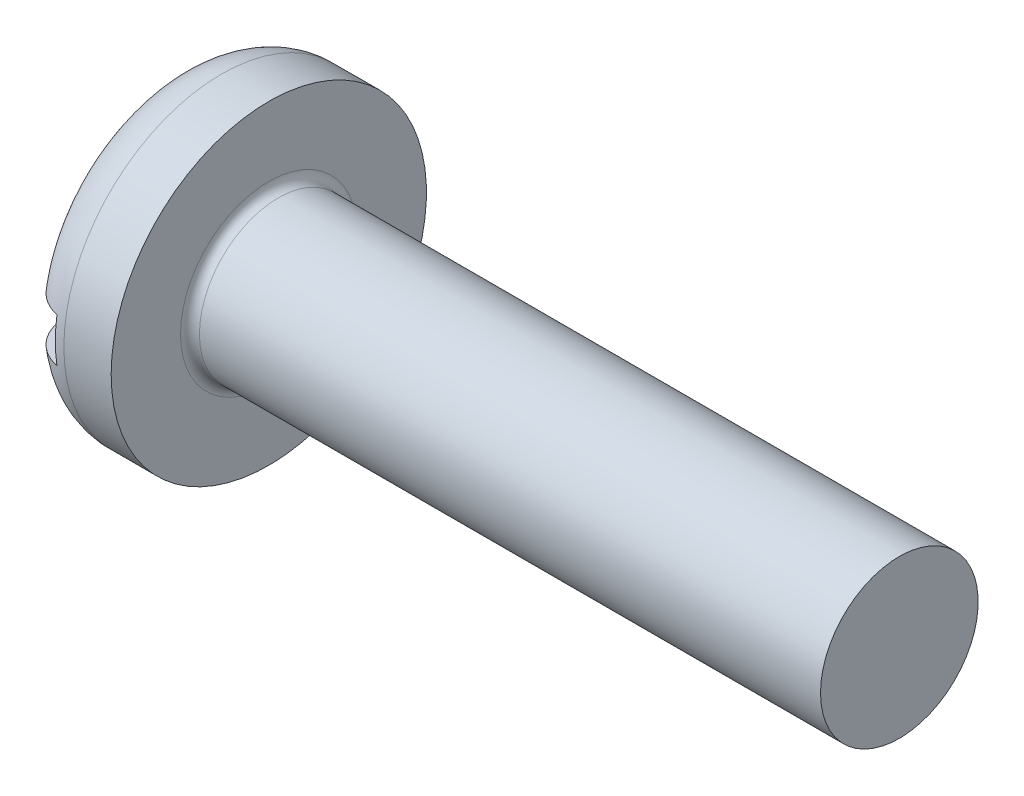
ISO-10303-21;
HEADER;
FILE_DESCRIPTION(('STEP AP214'),'2;1');
FILE_NAME('part.step','',(''),(''),'','','');
FILE_SCHEMA(('AUTOMOTIVE_DESIGN { 1 0 10303 214 1 1 1 1 }'));
ENDSEC;
DATA;
#1=APPLICATION_CONTEXT('core data for automotive mechanical design processes');
#2=APPLICATION_PROTOCOL_DEFINITION('international standard','automotive_design',2000,#1);
#3=PRODUCT_CONTEXT('',#1,'mechanical');
#4=PRODUCT('Part','Part','',(#3));
#5=PRODUCT_RELATED_PRODUCT_CATEGORY('part','',(#4));
#6=PRODUCT_DEFINITION_FORMATION('','',#4);
#7=PRODUCT_DEFINITION_CONTEXT('part definition',#1,'design');
#8=PRODUCT_DEFINITION('design','',#6,#7);
#9=PRODUCT_DEFINITION_SHAPE('','',#8);
#10=(LENGTH_UNIT() NAMED_UNIT(*) SI_UNIT(.MILLI.,.METRE.));
#11=(NAMED_UNIT(*) PLANE_ANGLE_UNIT() SI_UNIT($,.RADIAN.));
#12=(NAMED_UNIT(*) SI_UNIT($,.STERADIAN.) SOLID_ANGLE_UNIT());
#13=UNCERTAINTY_MEASURE_WITH_UNIT(LENGTH_MEASURE(1.E-05),#10,'distance_accuracy_value','');
#14=(GEOMETRIC_REPRESENTATION_CONTEXT(3) GLOBAL_UNCERTAINTY_ASSIGNED_CONTEXT((#13)) GLOBAL_UNIT_ASSIGNED_CONTEXT((#10,
#11,#12)) REPRESENTATION_CONTEXT('',''));
#15=CARTESIAN_POINT('',(0.,0.,0.));
#16=DIRECTION('',(0.,0.,1.));
#17=DIRECTION('',(1.,0.,0.));
#18=AXIS2_PLACEMENT_3D('',#15,#16,#17);
#19=CARTESIAN_POINT('',(0.,0.,0.));
#20=DIRECTION('',(1.,0.,0.));
#21=DIRECTION('',(0.,0.,-1.));
#22=AXIS2_PLACEMENT_3D('',#19,#20,#21);
#23=PLANE('',#22);
#24=CARTESIAN_POINT('',(0.,0.,0.));
#25=DIRECTION('',(1.,0.,0.));
#26=DIRECTION('',(0.,0.,-1.));
#27=AXIS2_PLACEMENT_3D('',#24,#25,#26);
#28=CIRCLE('',#27,7.);
#29=CARTESIAN_POINT('',(0.,1.405,6.85754876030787));
#30=VERTEX_POINT('',#29);
#31=CARTESIAN_POINT('',(0.,1.405,-6.85754876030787));
#32=VERTEX_POINT('',#31);
#33=EDGE_CURVE('E93',#30,#32,#28,.F.);
#34=ORIENTED_EDGE('',*,*,#33,.T.);
#35=DIRECTION('',(0.,0.,-1.));
#36=VECTOR('',#35,1.);
#37=CARTESIAN_POINT('',(0.,1.405,-10.));
#38=LINE('',#37,#36);
#39=EDGE_CURVE('E85',#30,#32,#38,.T.);
#40=ORIENTED_EDGE('',*,*,#39,.F.);
#41=EDGE_LOOP('',(#34,#40));
#42=FACE_BOUND('',#41,.T.);
#43=ADVANCED_FACE('F33',(#42),#23,.F.);
#44=CARTESIAN_POINT('',(0.,-1.405,-6.85754876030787));
#45=VERTEX_POINT('',#44);
#46=CARTESIAN_POINT('',(0.,-1.405,6.85754876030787));
#47=VERTEX_POINT('',#46);
#48=EDGE_CURVE('E84',#45,#47,#28,.F.);
#49=ORIENTED_EDGE('',*,*,#48,.T.);
#50=DIRECTION('',(0.,0.,1.));
#51=VECTOR('',#50,1.);
#52=CARTESIAN_POINT('',(0.,-1.405,-10.));
#53=LINE('',#52,#51);
#54=EDGE_CURVE('E77',#45,#47,#53,.T.);
#55=ORIENTED_EDGE('',*,*,#54,.F.);
#56=EDGE_LOOP('',(#49,#55));
#57=FACE_BOUND('',#56,.T.);
#58=ADVANCED_FACE('F83',(#57),#23,.F.);
#59=CARTESIAN_POINT('',(0.,0.,0.));
#60=DIRECTION('',(-1.,0.,0.));
#61=DIRECTION('',(0.,0.,1.));
#62=AXIS2_PLACEMENT_3D('',#59,#60,#61);
#63=CYLINDRICAL_SURFACE('',#62,10.);
#64=CARTESIAN_POINT('',(3.,0.,0.));
#65=DIRECTION('',(1.,0.,0.));
#66=DIRECTION('',(0.,0.,-1.));
#67=AXIS2_PLACEMENT_3D('',#64,#65,#66);
#68=CIRCLE('',#67,10.);
#69=CARTESIAN_POINT('',(3.,0.,-10.));
#70=VERTEX_POINT('',#69);
#71=EDGE_CURVE('E92',#70,#70,#68,.T.);
#72=ORIENTED_EDGE('',*,*,#71,.T.);
#73=EDGE_LOOP('',(#72));
#74=FACE_BOUND('',#73,.T.);
#75=CARTESIAN_POINT('',(6.,0.,0.));
#76=DIRECTION('',(-1.,0.,0.));
#77=DIRECTION('',(0.,0.,1.));
#78=AXIS2_PLACEMENT_3D('',#75,#76,#77);
#79=CIRCLE('',#78,10.);
#80=CARTESIAN_POINT('',(6.,0.,10.));
#81=VERTEX_POINT('',#80);
#82=EDGE_CURVE('E99',#81,#81,#79,.T.);
#83=ORIENTED_EDGE('',*,*,#82,.T.);
#84=EDGE_LOOP('',(#83));
#85=FACE_BOUND('',#84,.T.);
#86=ADVANCED_FACE('F143',(#74,#85),#63,.T.);
#87=CARTESIAN_POINT('',(6.,10.,0.));
#88=DIRECTION('',(-1.,0.,0.));
#89=DIRECTION('',(0.,0.,1.));
#90=AXIS2_PLACEMENT_3D('',#87,#88,#89);
#91=PLANE('',#90);
#92=CARTESIAN_POINT('',(6.,0.,0.));
#93=DIRECTION('',(-1.,0.,0.));
#94=DIRECTION('',(0.,0.,1.));
#95=AXIS2_PLACEMENT_3D('',#92,#93,#94);
#96=CIRCLE('',#95,5.6);
#97=CARTESIAN_POINT('',(6.,0.,5.6));
#98=VERTEX_POINT('',#97);
#99=EDGE_CURVE('E96',#98,#98,#96,.T.);
#100=ORIENTED_EDGE('',*,*,#99,.T.);
#101=EDGE_LOOP('',(#100));
#102=FACE_BOUND('',#101,.T.);
#103=ORIENTED_EDGE('',*,*,#82,.F.);
#104=EDGE_LOOP('',(#103));
#105=FACE_BOUND('',#104,.T.);
#106=ADVANCED_FACE('F139',(#102,#105),#91,.F.);
#107=CARTESIAN_POINT('',(0.,0.,0.));
#108=DIRECTION('',(-1.,0.,0.));
#109=DIRECTION('',(0.,0.,1.));
#110=AXIS2_PLACEMENT_3D('',#107,#108,#109);
#111=CYLINDRICAL_SURFACE('',#110,5.);
#112=CARTESIAN_POINT('',(6.6,0.,0.));
#113=DIRECTION('',(-1.,0.,0.));
#114=DIRECTION('',(0.,0.,1.));
#115=AXIS2_PLACEMENT_3D('',#112,#113,#114);
#116=CIRCLE('',#115,5.);
#117=CARTESIAN_POINT('',(6.6,0.,5.));
#118=VERTEX_POINT('',#117);
#119=EDGE_CURVE('E105',#118,#118,#116,.F.);
#120=ORIENTED_EDGE('',*,*,#119,.T.);
#121=EDGE_LOOP('',(#120));
#122=FACE_BOUND('',#121,.T.);
#123=CARTESIAN_POINT('',(46.,0.,0.));
#124=DIRECTION('',(-1.,0.,0.));
#125=DIRECTION('',(0.,0.,1.));
#126=AXIS2_PLACEMENT_3D('',#123,#124,#125);
#127=CIRCLE('',#126,5.);
#128=CARTESIAN_POINT('',(46.,0.,5.));
#129=VERTEX_POINT('',#128);
#130=EDGE_CURVE('E160',#129,#129,#127,.T.);
#131=ORIENTED_EDGE('',*,*,#130,.T.);
#132=EDGE_LOOP('',(#131));
#133=FACE_BOUND('',#132,.T.);
#134=ADVANCED_FACE('F135',(#122,#133),#111,.T.);
#135=CARTESIAN_POINT('',(46.,5.,0.));
#136=DIRECTION('',(-1.,0.,0.));
#137=DIRECTION('',(0.,0.,1.));
#138=AXIS2_PLACEMENT_3D('',#135,#136,#137);
#139=PLANE('',#138);
#140=ORIENTED_EDGE('',*,*,#130,.F.);
#141=EDGE_LOOP('',(#140));
#142=FACE_BOUND('',#141,.T.);
#143=ADVANCED_FACE('F128',(#142),#139,.F.);
#144=CARTESIAN_POINT('',(3.,0.,0.));
#145=DIRECTION('',(1.,0.,0.));
#146=DIRECTION('',(0.,0.,-1.));
#147=AXIS2_PLACEMENT_3D('',#144,#145,#146);
#148=TOROIDAL_SURFACE('',#147,7.,3.);
#149=CARTESIAN_POINT('',(1.34955640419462,1.405,-9.40078910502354));
#150=CARTESIAN_POINT('',(1.48879597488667,1.405,-9.49353120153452));
#151=CARTESIAN_POINT('',(1.63593026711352,1.405,-9.57463164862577));
#152=CARTESIAN_POINT('',(1.94183816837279,1.405,-9.71106416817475));
#153=CARTESIAN_POINT('',(2.10062466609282,1.405,-9.76636719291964));
#154=CARTESIAN_POINT('',(2.42520767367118,1.405,-9.84947012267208));
#155=CARTESIAN_POINT('',(2.59100215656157,1.405,-9.87727792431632));
#156=CARTESIAN_POINT('',(2.92486435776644,1.405,-9.90457544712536));
#157=CARTESIAN_POINT('',(3.09293152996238,1.405,-9.90407185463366));
#158=CARTESIAN_POINT('',(3.42617704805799,1.405,-9.87481774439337));
#159=CARTESIAN_POINT('',(3.59136140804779,1.405,-9.84613568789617));
#160=CARTESIAN_POINT('',(3.91458160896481,1.405,-9.76147201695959));
#161=CARTESIAN_POINT('',(4.07261723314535,1.405,-9.7054895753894));
#162=CARTESIAN_POINT('',(4.37724541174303,1.405,-9.56780073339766));
#163=CARTESIAN_POINT('',(4.52382605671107,1.405,-9.48606799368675));
#164=CARTESIAN_POINT('',(4.80128628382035,1.405,-9.29928792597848));
#165=CARTESIAN_POINT('',(4.93216560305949,1.405,-9.19424020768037));
#166=CARTESIAN_POINT('',(5.17535921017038,1.405,-8.96319642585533));
#167=CARTESIAN_POINT('',(5.28756102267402,1.405,-8.8370820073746));
#168=CARTESIAN_POINT('',(5.48946156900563,1.405,-8.56797826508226));
#169=CARTESIAN_POINT('',(5.57915940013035,1.405,-8.42498826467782));
#170=CARTESIAN_POINT('',(5.73457932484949,1.405,-8.12457615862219));
#171=CARTESIAN_POINT('',(5.80003374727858,1.405,-7.96701562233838));
#172=CARTESIAN_POINT('',(5.90400580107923,1.405,-7.64325136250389));
#173=CARTESIAN_POINT('',(5.94252156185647,1.405,-7.47704703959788));
#174=CARTESIAN_POINT('',(5.99219224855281,1.405,-7.13797894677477));
#175=CARTESIAN_POINT('',(6.00291535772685,1.405,-6.96505196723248));
#176=CARTESIAN_POINT('',(5.99572826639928,1.405,-6.61979813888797));
#177=CARTESIAN_POINT('',(5.97781531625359,1.405,-6.44747134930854));
#178=CARTESIAN_POINT('',(5.91349214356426,1.405,-6.10496456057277));
#179=CARTESIAN_POINT('',(5.8665682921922,1.405,-5.93488099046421));
#180=CARTESIAN_POINT('',(5.74524036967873,1.405,-5.60480593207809));
#181=CARTESIAN_POINT('',(5.67083305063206,1.405,-5.444815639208));
#182=CARTESIAN_POINT('',(5.49537114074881,1.405,-5.13716246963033));
#183=CARTESIAN_POINT('',(5.39395573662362,1.405,-4.98970513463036));
#184=CARTESIAN_POINT('',(5.16767260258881,1.405,-4.7139904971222));
#185=CARTESIAN_POINT('',(5.04280270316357,1.405,-4.58573497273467));
#186=CARTESIAN_POINT('',(4.77368816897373,1.405,-4.35327294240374));
#187=CARTESIAN_POINT('',(4.6295670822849,1.405,-4.24892374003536));
#188=CARTESIAN_POINT('',(4.32522065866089,1.405,-4.06716162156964));
#189=CARTESIAN_POINT('',(4.16500054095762,1.405,-3.98974001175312));
#190=CARTESIAN_POINT('',(3.84030664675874,1.405,-3.8679477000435));
#191=CARTESIAN_POINT('',(3.676314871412,1.405,-3.82229480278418));
#192=CARTESIAN_POINT('',(3.34283714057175,1.405,-3.76101136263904));
#193=CARTESIAN_POINT('',(3.17335378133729,1.405,-3.74536683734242));
#194=CARTESIAN_POINT('',(2.84379787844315,1.405,-3.74490534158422));
#195=CARTESIAN_POINT('',(2.68372521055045,1.405,-3.75842524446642));
#196=CARTESIAN_POINT('',(2.36817167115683,1.405,-3.81228751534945));
#197=CARTESIAN_POINT('',(2.21269092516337,1.405,-3.85263061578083));
#198=CARTESIAN_POINT('',(1.91111604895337,1.405,-3.95817017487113));
#199=CARTESIAN_POINT('',(1.76498868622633,1.405,-4.02327219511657));
#200=CARTESIAN_POINT('',(1.48497822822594,1.405,-4.17591024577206));
#201=CARTESIAN_POINT('',(1.3510977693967,1.405,-4.26345109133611));
#202=CARTESIAN_POINT('',(1.0920675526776,1.405,-4.46321328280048));
#203=CARTESIAN_POINT('',(0.967715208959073,1.405,-4.5764683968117));
#204=CARTESIAN_POINT('',(0.738674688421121,1.405,-4.82137026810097));
#205=CARTESIAN_POINT('',(0.633991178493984,1.405,-4.95302137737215));
#206=CARTESIAN_POINT('',(0.442157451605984,1.405,-5.23800445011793));
#207=CARTESIAN_POINT('',(0.356110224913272,1.405,-5.39208030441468));
#208=CARTESIAN_POINT('',(0.210647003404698,1.405,-5.71233809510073));
#209=CARTESIAN_POINT('',(0.151233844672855,1.405,-5.87852131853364));
#210=CARTESIAN_POINT('',(0.0601105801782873,1.405,-6.22102624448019));
#211=CARTESIAN_POINT('',(0.0288317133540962,1.405,-6.39746303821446));
#212=CARTESIAN_POINT('',(-0.00333204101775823,1.405,-6.75308736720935));
#213=CARTESIAN_POINT('',(-0.0042191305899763,1.405,-6.93227470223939));
#214=CARTESIAN_POINT('',(0.0245567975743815,1.405,-7.28631739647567));
#215=CARTESIAN_POINT('',(0.0539031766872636,1.405,-7.46119840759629));
#216=CARTESIAN_POINT('',(0.142109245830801,1.405,-7.80341005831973));
#217=CARTESIAN_POINT('',(0.200973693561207,1.405,-7.97073947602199));
#218=CARTESIAN_POINT('',(0.345399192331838,1.405,-8.28983936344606));
#219=CARTESIAN_POINT('',(0.430465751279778,1.405,-8.44183397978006));
#220=CARTESIAN_POINT('',(0.625268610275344,1.405,-8.72890876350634));
#221=CARTESIAN_POINT('',(0.73497205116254,1.405,-8.86401109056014));
#222=CARTESIAN_POINT('',(0.930061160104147,1.405,-9.06590290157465));
#223=CARTESIAN_POINT('',(1.00887229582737,1.405,-9.13915754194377));
#224=CARTESIAN_POINT('',(1.17388808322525,1.405,-9.27680643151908));
#225=CARTESIAN_POINT('',(1.26009266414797,1.405,-9.34120076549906));
#226=CARTESIAN_POINT('',(1.34955640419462,1.405,-9.40078910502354));
#227=B_SPLINE_CURVE_WITH_KNOTS('',3,(#149,#150,#151,#152,#153,#154,#155,#156,#157,#158,#159,
#160,#161,#162,#163,#164,#165,#166,#167,#168,#169,#170,#171,#172,#173,#174,#175,#176,#177,#178,
#179,#180,#181,#182,#183,#184,#185,#186,#187,#188,#189,#190,#191,#192,#193,#194,#195,#196,#197,
#198,#199,#200,#201,#202,#203,#204,#205,#206,#207,#208,#209,#210,#211,#212,#213,#214,#215,#216,
#217,#218,#219,#220,#221,#222,#223,#224,#225,#226),.UNSPECIFIED.,.T.,.F.,(4,2,2,2,2,2,2,2,2,2,2,
2,2,2,2,2,2,2,2,2,2,2,2,2,2,2,2,2,2,2,2,2,2,2,2,2,2,2,4),(0.,0.501505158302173,1.0035736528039,
1.50549791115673,2.0073036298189,2.50789318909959,3.00849791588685,3.50961636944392,
4.01074321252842,4.51478645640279,5.01884991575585,5.5283236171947,6.0378326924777,
6.55521186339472,7.07264071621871,7.59950372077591,8.12642900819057,8.66078135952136,
9.19518316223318,9.72630681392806,10.25725882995,10.7652962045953,11.2730968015,
11.7527077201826,12.2323317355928,12.7101443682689,13.1880596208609,13.6904322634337,
14.1929239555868,14.7199022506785,15.246936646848,15.7819181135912,16.3168608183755,
16.846257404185,17.3757393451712,17.8957847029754,18.4151405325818,18.7373690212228,
19.0595944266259),.UNSPECIFIED.);
#228=CARTESIAN_POINT('',(2.4,1.405,-9.83958346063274));
#229=VERTEX_POINT('',#228);
#230=EDGE_CURVE('E11',#32,#229,#227,.T.);
#231=ORIENTED_EDGE('',*,*,#230,.F.);
#232=ORIENTED_EDGE('',*,*,#33,.F.);
#233=CARTESIAN_POINT('',(1.31929866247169,1.405,4.29082361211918));
#234=CARTESIAN_POINT('',(1.45286647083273,1.405,4.19577245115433));
#235=CARTESIAN_POINT('',(1.59416934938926,1.405,4.11144874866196));
#236=CARTESIAN_POINT('',(1.88885767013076,1.405,3.9672578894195));
#237=CARTESIAN_POINT('',(2.0422496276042,1.405,3.90740402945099));
#238=CARTESIAN_POINT('',(2.35732943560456,1.405,3.81459653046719));
#239=CARTESIAN_POINT('',(2.51903214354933,1.405,3.78169298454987));
#240=CARTESIAN_POINT('',(2.8456648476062,1.405,3.74457442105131));
#241=CARTESIAN_POINT('',(3.01059369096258,1.405,3.74034933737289));
#242=CARTESIAN_POINT('',(3.33333020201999,1.405,3.76043743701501));
#243=CARTESIAN_POINT('',(3.49119597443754,1.405,3.7838345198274));
#244=CARTESIAN_POINT('',(3.80082163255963,1.405,3.85657629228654));
#245=CARTESIAN_POINT('',(3.95258070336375,1.405,3.90592443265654));
#246=CARTESIAN_POINT('',(4.24742509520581,1.405,4.02910768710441));
#247=CARTESIAN_POINT('',(4.39041702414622,1.405,4.1031654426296));
#248=CARTESIAN_POINT('',(4.66283508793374,1.405,4.27301479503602));
#249=CARTESIAN_POINT('',(4.79225817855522,1.405,4.36881125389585));
#250=CARTESIAN_POINT('',(5.04140734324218,1.405,4.58508449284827));
#251=CARTESIAN_POINT('',(5.16020527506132,1.405,4.70663085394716));
#252=CARTESIAN_POINT('',(5.37676607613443,1.405,4.96720910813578));
#253=CARTESIAN_POINT('',(5.4745243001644,1.405,5.10624485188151));
#254=CARTESIAN_POINT('',(5.65039445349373,1.405,5.404478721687));
#255=CARTESIAN_POINT('',(5.72746808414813,1.405,5.56429044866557));
#256=CARTESIAN_POINT('',(5.85398164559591,1.405,5.89451078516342));
#257=CARTESIAN_POINT('',(5.90341948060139,1.405,6.06492019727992));
#258=CARTESIAN_POINT('',(5.97343316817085,1.405,6.41321282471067));
#259=CARTESIAN_POINT('',(5.99374070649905,1.405,6.59115017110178));
#260=CARTESIAN_POINT('',(6.00378122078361,1.405,6.9478934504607));
#261=CARTESIAN_POINT('',(5.99351574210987,1.405,7.12669933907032));
#262=CARTESIAN_POINT('',(5.94275147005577,1.405,7.47762528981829));
#263=CARTESIAN_POINT('',(5.90264330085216,1.405,7.64980176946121));
#264=CARTESIAN_POINT('',(5.79354154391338,1.405,7.98475159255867));
#265=CARTESIAN_POINT('',(5.72455071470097,1.405,8.14752583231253));
#266=CARTESIAN_POINT('',(5.56103031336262,1.405,8.45584633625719));
#267=CARTESIAN_POINT('',(5.46699591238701,1.405,8.60165524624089));
#268=CARTESIAN_POINT('',(5.25541224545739,1.405,8.87508027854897));
#269=CARTESIAN_POINT('',(5.13786507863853,1.405,9.00269802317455));
#270=CARTESIAN_POINT('',(4.88462978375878,1.405,9.233997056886));
#271=CARTESIAN_POINT('',(4.74925929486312,1.405,9.33802620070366));
#272=CARTESIAN_POINT('',(4.46281557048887,1.405,9.52158182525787));
#273=CARTESIAN_POINT('',(4.31174335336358,1.405,9.60110989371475));
#274=CARTESIAN_POINT('',(3.999977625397,1.405,9.73253259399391));
#275=CARTESIAN_POINT('',(3.83940768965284,1.405,9.78472049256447));
#276=CARTESIAN_POINT('',(3.51175990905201,1.405,9.86121968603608));
#277=CARTESIAN_POINT('',(3.344682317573,1.405,9.88553206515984));
#278=CARTESIAN_POINT('',(3.00981166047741,1.405,9.90549520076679));
#279=CARTESIAN_POINT('',(2.84202855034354,1.405,9.90131334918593));
#280=CARTESIAN_POINT('',(2.50955466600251,1.405,9.86480760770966));
#281=CARTESIAN_POINT('',(2.34486384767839,1.405,9.83248411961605));
#282=CARTESIAN_POINT('',(2.02341276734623,1.405,9.74069922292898));
#283=CARTESIAN_POINT('',(1.86664457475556,1.405,9.68126557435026));
#284=CARTESIAN_POINT('',(1.56526114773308,1.405,9.5370165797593));
#285=CARTESIAN_POINT('',(1.42064600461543,1.405,9.45220104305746));
#286=CARTESIAN_POINT('',(1.14706627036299,1.405,9.25930055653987));
#287=CARTESIAN_POINT('',(1.01816199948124,1.405,9.15113008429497));
#288=CARTESIAN_POINT('',(0.780156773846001,1.405,8.91484933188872));
#289=CARTESIAN_POINT('',(0.671056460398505,1.405,8.78673840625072));
#290=CARTESIAN_POINT('',(0.474713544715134,1.405,8.51306937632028));
#291=CARTESIAN_POINT('',(0.387666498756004,1.405,8.36737101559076));
#292=CARTESIAN_POINT('',(0.238901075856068,1.405,8.06357816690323));
#293=CARTESIAN_POINT('',(0.177184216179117,1.405,7.90548293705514));
#294=CARTESIAN_POINT('',(0.079899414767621,1.405,7.57911909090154));
#295=CARTESIAN_POINT('',(0.044695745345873,1.405,7.41074194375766));
#296=CARTESIAN_POINT('',(0.00253465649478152,1.405,7.07050005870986));
#297=CARTESIAN_POINT('',(-0.00442147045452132,1.405,6.89863516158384));
#298=CARTESIAN_POINT('',(0.00996591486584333,1.405,6.55310394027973));
#299=CARTESIAN_POINT('',(0.0318033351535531,1.405,6.37945821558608));
#300=CARTESIAN_POINT('',(0.103814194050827,1.405,6.03809931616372));
#301=CARTESIAN_POINT('',(0.153997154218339,1.405,5.87038815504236));
#302=CARTESIAN_POINT('',(0.282308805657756,1.405,5.54259653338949));
#303=CARTESIAN_POINT('',(0.360916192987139,1.405,5.38270356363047));
#304=CARTESIAN_POINT('',(0.543669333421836,1.405,5.07838245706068));
#305=CARTESIAN_POINT('',(0.647791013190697,1.405,4.93393992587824));
#306=CARTESIAN_POINT('',(0.845230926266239,1.405,4.70375730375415));
#307=CARTESIAN_POINT('',(0.932931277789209,1.405,4.61313821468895));
#308=CARTESIAN_POINT('',(1.11866613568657,1.405,4.4431775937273));
#309=CARTESIAN_POINT('',(1.21670042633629,1.405,4.36383582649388));
#310=CARTESIAN_POINT('',(1.31929866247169,1.405,4.29082361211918));
#311=B_SPLINE_CURVE_WITH_KNOTS('',3,(#233,#234,#235,#236,#237,#238,#239,#240,#241,#242,#243,
#244,#245,#246,#247,#248,#249,#250,#251,#252,#253,#254,#255,#256,#257,#258,#259,#260,#261,#262,
#263,#264,#265,#266,#267,#268,#269,#270,#271,#272,#273,#274,#275,#276,#277,#278,#279,#280,#281,
#282,#283,#284,#285,#286,#287,#288,#289,#290,#291,#292,#293,#294,#295,#296,#297,#298,#299,#300,
#301,#302,#303,#304,#305,#306,#307,#308,#309,#310),.UNSPECIFIED.,.T.,.F.,(4,2,2,2,2,2,2,2,2,2,2,
2,2,2,2,2,2,2,2,2,2,2,2,2,2,2,2,2,2,2,2,2,2,2,2,2,2,2,4),(0.,0.491384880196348,
0.983036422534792,1.47559974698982,1.96799017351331,2.44449864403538,2.9210704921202,
3.40205789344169,3.88315297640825,4.39077460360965,4.89850819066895,5.42830477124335,
5.95814152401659,6.49282785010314,7.02748714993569,7.55526852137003,8.08299949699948,
8.6009845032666,9.11892328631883,9.6286391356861,10.1383219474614,10.6424194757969,
11.1464973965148,11.6476166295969,12.1487287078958,12.6493288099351,13.1499326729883,
13.6524017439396,14.1548870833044,14.6616834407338,15.1685101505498,15.6821792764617,
16.1958719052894,16.718491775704,17.2412873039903,17.773331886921,18.3048763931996,
18.6823346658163,19.0597850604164),.UNSPECIFIED.);
#312=CARTESIAN_POINT('',(2.4,1.405,9.83958346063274));
#313=VERTEX_POINT('',#312);
#314=EDGE_CURVE('E115',#313,#30,#311,.T.);
#315=ORIENTED_EDGE('',*,*,#314,.F.);
#316=CARTESIAN_POINT('',(2.4,0.,0.));
#317=DIRECTION('',(-1.,0.,0.));
#318=DIRECTION('',(0.,0.,1.));
#319=AXIS2_PLACEMENT_3D('',#316,#317,#318);
#320=CIRCLE('',#319,9.93938769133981);
#321=CARTESIAN_POINT('',(2.4,-1.405,9.83958346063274));
#322=VERTEX_POINT('',#321);
#323=EDGE_CURVE('E108',#313,#322,#320,.F.);
#324=ORIENTED_EDGE('',*,*,#323,.T.);
#325=CARTESIAN_POINT('',(1.31929866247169,-1.405,4.29082361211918));
#326=CARTESIAN_POINT('',(1.17578997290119,-1.405,4.39296323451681));
#327=CARTESIAN_POINT('',(1.04100610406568,-1.405,4.50764267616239));
#328=CARTESIAN_POINT('',(0.792517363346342,-1.405,4.75817905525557));
#329=CARTESIAN_POINT('',(0.678851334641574,-1.405,4.89407418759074));
#330=CARTESIAN_POINT('',(0.475850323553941,-1.405,5.18266479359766));
#331=CARTESIAN_POINT('',(0.386478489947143,-1.405,5.33533432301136));
#332=CARTESIAN_POINT('',(0.234281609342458,-1.405,5.65329273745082));
#333=CARTESIAN_POINT('',(0.171445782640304,-1.405,5.81857646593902));
#334=CARTESIAN_POINT('',(0.0734555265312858,-1.405,6.15951632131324));
#335=CARTESIAN_POINT('',(0.0386734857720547,-1.405,6.33527975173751));
#336=CARTESIAN_POINT('',(-0.000597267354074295,-1.405,6.69018328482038));
#337=CARTESIAN_POINT('',(-0.00508430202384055,-1.405,6.86932357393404));
#338=CARTESIAN_POINT('',(0.0165532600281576,-1.405,7.22408001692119));
#339=CARTESIAN_POINT('',(0.0423929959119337,-1.405,7.3997134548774));
#340=CARTESIAN_POINT('',(0.123750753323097,-1.405,7.74397123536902));
#341=CARTESIAN_POINT('',(0.179265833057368,-1.405,7.91259627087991));
#342=CARTESIAN_POINT('',(0.317309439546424,-1.405,8.23477352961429));
#343=CARTESIAN_POINT('',(0.39932847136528,-1.405,8.38854405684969));
#344=CARTESIAN_POINT('',(0.588441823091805,-1.405,8.6798077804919));
#345=CARTESIAN_POINT('',(0.695533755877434,-1.405,8.81730252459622));
#346=CARTESIAN_POINT('',(0.929779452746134,-1.405,9.06967233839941));
#347=CARTESIAN_POINT('',(1.05656456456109,-1.405,9.18488966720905));
#348=CARTESIAN_POINT('',(1.3278837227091,-1.405,9.3920851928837));
#349=CARTESIAN_POINT('',(1.47241653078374,-1.405,9.48406500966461));
#350=CARTESIAN_POINT('',(1.77321469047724,-1.405,9.64103173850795));
#351=CARTESIAN_POINT('',(1.92931541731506,-1.405,9.70633423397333));
#352=CARTESIAN_POINT('',(2.25031311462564,-1.405,9.80959346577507));
#353=CARTESIAN_POINT('',(2.41520968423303,-1.405,9.84755144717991));
#354=CARTESIAN_POINT('',(2.74786501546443,-1.405,9.89481576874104));
#355=CARTESIAN_POINT('',(2.91559527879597,-1.405,9.90432288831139));
#356=CARTESIAN_POINT('',(3.25026165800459,-1.405,9.89497489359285));
#357=CARTESIAN_POINT('',(3.41719778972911,-1.405,9.87612034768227));
#358=CARTESIAN_POINT('',(3.74516229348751,-1.405,9.81068107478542));
#359=CARTESIAN_POINT('',(3.90620270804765,-1.405,9.76415665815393));
#360=CARTESIAN_POINT('',(4.2182152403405,-1.405,9.64479873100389));
#361=CARTESIAN_POINT('',(4.36918733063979,-1.405,9.57196514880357));
#362=CARTESIAN_POINT('',(4.65722194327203,-1.405,9.40190043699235));
#363=CARTESIAN_POINT('',(4.79424759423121,-1.405,9.30460687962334));
#364=CARTESIAN_POINT('',(5.05016777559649,-1.405,9.08855162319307));
#365=CARTESIAN_POINT('',(5.16906183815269,-1.405,8.96978937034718));
#366=CARTESIAN_POINT('',(5.38632411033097,-1.405,8.71326285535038));
#367=CARTESIAN_POINT('',(5.48453397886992,-1.405,8.57536452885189));
#368=CARTESIAN_POINT('',(5.65673098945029,-1.405,8.28520097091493));
#369=CARTESIAN_POINT('',(5.73071692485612,-1.405,8.13293502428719));
#370=CARTESIAN_POINT('',(5.85338428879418,-1.405,7.81637205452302));
#371=CARTESIAN_POINT('',(5.90174261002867,-1.405,7.65194988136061));
#372=CARTESIAN_POINT('',(5.97066265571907,-1.405,7.3173860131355));
#373=CARTESIAN_POINT('',(5.99122219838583,-1.405,7.14724387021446));
#374=CARTESIAN_POINT('',(6.00435022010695,-1.405,6.80303726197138));
#375=CARTESIAN_POINT('',(5.99644511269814,-1.405,6.62895476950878));
#376=CARTESIAN_POINT('',(5.9520634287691,-1.405,6.28447275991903));
#377=CARTESIAN_POINT('',(5.91558393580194,-1.405,6.11407362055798));
#378=CARTESIAN_POINT('',(5.81432823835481,-1.405,5.77853971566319));
#379=CARTESIAN_POINT('',(5.74905383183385,-1.405,5.61355520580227));
#380=CARTESIAN_POINT('',(5.59200815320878,-1.405,5.29669951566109));
#381=CARTESIAN_POINT('',(5.50023349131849,-1.405,5.14483001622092));
#382=CARTESIAN_POINT('',(5.2916206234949,-1.405,4.85710118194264));
#383=CARTESIAN_POINT('',(5.17454613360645,-1.405,4.72141290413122));
#384=CARTESIAN_POINT('',(4.91892280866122,-1.405,4.47198770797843));
#385=CARTESIAN_POINT('',(4.78037370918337,-1.405,4.35825105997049));
#386=CARTESIAN_POINT('',(4.48800621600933,-1.405,4.15848806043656));
#387=CARTESIAN_POINT('',(4.3344906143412,-1.405,4.07201972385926));
#388=CARTESIAN_POINT('',(4.01454290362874,-1.405,3.92775644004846));
#389=CARTESIAN_POINT('',(3.84811752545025,-1.405,3.86994666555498));
#390=CARTESIAN_POINT('',(3.51655578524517,-1.405,3.78802909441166));
#391=CARTESIAN_POINT('',(3.35182214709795,-1.405,3.76229150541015));
#392=CARTESIAN_POINT('',(3.02036934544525,-1.405,3.74030228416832));
#393=CARTESIAN_POINT('',(2.85365026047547,-1.405,3.74404948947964));
#394=CARTESIAN_POINT('',(2.53088194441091,-1.405,3.77999437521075));
#395=CARTESIAN_POINT('',(2.37468783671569,-1.405,3.8109200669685));
#396=CARTESIAN_POINT('',(2.06968620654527,-1.405,3.89808458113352));
#397=CARTESIAN_POINT('',(1.92087058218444,-1.405,3.95429492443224));
#398=CARTESIAN_POINT('',(1.6974298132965,-1.405,4.05988310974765));
#399=CARTESIAN_POINT('',(1.61897519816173,-1.405,4.10138219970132));
#400=CARTESIAN_POINT('',(1.46604265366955,-1.405,4.19113577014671));
#401=CARTESIAN_POINT('',(1.39156445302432,-1.405,4.23938978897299));
#402=CARTESIAN_POINT('',(1.31929866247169,-1.405,4.29082361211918));
#403=B_SPLINE_CURVE_WITH_KNOTS('',3,(#325,#326,#327,#328,#329,#330,#331,#332,#333,#334,#335,
#336,#337,#338,#339,#340,#341,#342,#343,#344,#345,#346,#347,#348,#349,#350,#351,#352,#353,#354,
#355,#356,#357,#358,#359,#360,#361,#362,#363,#364,#365,#366,#367,#368,#369,#370,#371,#372,#373,
#374,#375,#376,#377,#378,#379,#380,#381,#382,#383,#384,#385,#386,#387,#388,#389,#390,#391,#392,
#393,#394,#395,#396,#397,#398,#399,#400,#401,#402),.UNSPECIFIED.,.T.,.F.,(4,2,2,2,2,2,2,2,2,2,2,
2,2,2,2,2,2,2,2,2,2,2,2,2,2,2,2,2,2,2,2,2,2,2,2,2,2,2,4),(0.,0.528101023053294,1.05716399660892,
1.58541991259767,2.11346102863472,2.64840110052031,3.1833707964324,3.71335544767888,
4.24328756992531,4.76358475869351,5.28383243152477,5.79530943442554,6.30675077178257,
6.81195334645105,7.31713291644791,7.81873889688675,8.32033482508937,8.82084144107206,
9.32134942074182,9.8231480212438,10.3249595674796,10.8304831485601,11.3360319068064,
11.8478113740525,12.3596310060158,12.8800051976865,13.4004325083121,13.9302406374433,
14.4601165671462,14.9951733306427,15.530236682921,16.0561190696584,16.5817290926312,
17.0793678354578,17.5769869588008,18.0524875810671,18.527453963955,18.7934047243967,
19.0593373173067),.UNSPECIFIED.);
#404=EDGE_CURVE('E91',#47,#322,#403,.T.);
#405=ORIENTED_EDGE('',*,*,#404,.F.);
#406=ORIENTED_EDGE('',*,*,#48,.F.);
#407=CARTESIAN_POINT('',(1.34955640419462,-1.405,-9.40078910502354));
#408=CARTESIAN_POINT('',(1.20852040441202,-1.405,-9.30683188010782));
#409=CARTESIAN_POINT('',(1.07537573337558,-1.405,-9.20078794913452));
#410=CARTESIAN_POINT('',(0.828746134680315,-1.405,-8.9676874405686));
#411=CARTESIAN_POINT('',(0.715287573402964,-1.405,-8.84060312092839));
#412=CARTESIAN_POINT('',(0.51136666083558,-1.405,-8.56935270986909));
#413=CARTESIAN_POINT('',(0.420881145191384,-1.405,-8.42520404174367));
#414=CARTESIAN_POINT('',(0.265156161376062,-1.405,-8.12392654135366));
#415=CARTESIAN_POINT('',(0.199910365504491,-1.405,-7.96680097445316));
#416=CARTESIAN_POINT('',(0.0956890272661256,-1.405,-7.64234203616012));
#417=CARTESIAN_POINT('',(0.0569818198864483,-1.405,-7.47492252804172));
#418=CARTESIAN_POINT('',(0.00770570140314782,-1.405,-7.1359912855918));
#419=CARTESIAN_POINT('',(-0.00285973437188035,-1.405,-6.96447904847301));
#420=CARTESIAN_POINT('',(0.00424257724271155,-1.405,-6.61907331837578));
#421=CARTESIAN_POINT('',(0.0224019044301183,-1.405,-6.44518995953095));
#422=CARTESIAN_POINT('',(0.0871313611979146,-1.405,-6.10279449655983));
#423=CARTESIAN_POINT('',(0.133704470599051,-1.405,-5.93428295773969));
#424=CARTESIAN_POINT('',(0.254892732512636,-1.405,-5.60429803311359));
#425=CARTESIAN_POINT('',(0.329985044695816,-1.405,-5.44299975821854));
#426=CARTESIAN_POINT('',(0.506000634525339,-1.405,-5.13514619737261));
#427=CARTESIAN_POINT('',(0.606927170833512,-1.405,-4.9885927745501));
#428=CARTESIAN_POINT('',(0.832694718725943,-1.405,-4.71357984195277));
#429=CARTESIAN_POINT('',(0.957688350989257,-1.405,-4.58524541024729));
#430=CARTESIAN_POINT('',(1.22790964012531,-1.405,-4.35195843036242));
#431=CARTESIAN_POINT('',(1.37313605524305,-1.405,-4.24700444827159));
#432=CARTESIAN_POINT('',(1.67622817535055,-1.405,-4.06660156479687));
#433=CARTESIAN_POINT('',(1.8337085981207,-1.405,-3.99050713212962));
#434=CARTESIAN_POINT('',(2.15971496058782,-1.405,-3.8676641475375));
#435=CARTESIAN_POINT('',(2.32823513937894,-1.405,-3.82090042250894));
#436=CARTESIAN_POINT('',(2.66128049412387,-1.405,-3.76081081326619));
#437=CARTESIAN_POINT('',(2.82549183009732,-1.405,-3.7457419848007));
#438=CARTESIAN_POINT('',(3.15400107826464,-1.405,-3.74454911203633));
#439=CARTESIAN_POINT('',(3.31829896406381,-1.405,-3.75841881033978));
#440=CARTESIAN_POINT('',(3.63611965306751,-1.405,-3.81337266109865));
#441=CARTESIAN_POINT('',(3.78981735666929,-1.405,-3.85345719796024));
#442=CARTESIAN_POINT('',(4.08861556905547,-1.405,-3.95812778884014));
#443=CARTESIAN_POINT('',(4.23371470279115,-1.405,-4.02271774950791));
#444=CARTESIAN_POINT('',(4.51592813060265,-1.405,-4.17624987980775));
#445=CARTESIAN_POINT('',(4.65268296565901,-1.405,-4.26585128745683));
#446=CARTESIAN_POINT('',(4.91028056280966,-1.405,-4.46556557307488));
#447=CARTESIAN_POINT('',(5.03111945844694,-1.405,-4.57568341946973));
#448=CARTESIAN_POINT('',(5.26059234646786,-1.405,-4.82011642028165));
#449=CARTESIAN_POINT('',(5.36814074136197,-1.405,-4.95545184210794));
#450=CARTESIAN_POINT('',(5.55986531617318,-1.405,-5.24178028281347));
#451=CARTESIAN_POINT('',(5.64403720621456,-1.405,-5.39277616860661));
#452=CARTESIAN_POINT('',(5.78916616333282,-1.405,-5.71154961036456));
#453=CARTESIAN_POINT('',(5.84927523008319,-1.405,-5.879714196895));
#454=CARTESIAN_POINT('',(5.94042011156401,-1.405,-6.22375515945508));
#455=CARTESIAN_POINT('',(5.97145514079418,-1.405,-6.39963174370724));
#456=CARTESIAN_POINT('',(6.00333477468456,-1.405,-6.75412954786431));
#457=CARTESIAN_POINT('',(6.00417713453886,-1.405,-6.93275097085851));
#458=CARTESIAN_POINT('',(5.9753486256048,-1.405,-7.28752141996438));
#459=CARTESIAN_POINT('',(5.94568000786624,-1.405,-7.4636706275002));
#460=CARTESIAN_POINT('',(5.85714281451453,-1.405,-7.8054523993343));
#461=CARTESIAN_POINT('',(5.79875144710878,-1.405,-7.97120852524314));
#462=CARTESIAN_POINT('',(5.65446060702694,-1.405,-8.29028654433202));
#463=CARTESIAN_POINT('',(5.56856375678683,-1.405,-8.44360962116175));
#464=CARTESIAN_POINT('',(5.3734064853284,-1.405,-8.73051530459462));
#465=CARTESIAN_POINT('',(5.2645986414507,-1.405,-8.86440581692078));
#466=CARTESIAN_POINT('',(5.02575040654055,-1.405,-9.11168154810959));
#467=CARTESIAN_POINT('',(4.8957117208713,-1.405,-9.22506841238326));
#468=CARTESIAN_POINT('',(4.62013025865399,-1.405,-9.42642575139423));
#469=CARTESIAN_POINT('',(4.47483735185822,-1.405,-9.51473830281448));
#470=CARTESIAN_POINT('',(4.171387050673,-1.405,-9.66544684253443));
#471=CARTESIAN_POINT('',(4.01323090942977,-1.405,-9.72784535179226));
#472=CARTESIAN_POINT('',(3.69014795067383,-1.405,-9.8243933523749));
#473=CARTESIAN_POINT('',(3.52529895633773,-1.405,-9.85880343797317));
#474=CARTESIAN_POINT('',(3.19211277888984,-1.405,-9.89933357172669));
#475=CARTESIAN_POINT('',(3.0237748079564,-1.405,-9.90544715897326));
#476=CARTESIAN_POINT('',(2.68913758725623,-1.405,-9.88922535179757));
#477=CARTESIAN_POINT('',(2.52283301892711,-1.405,-9.86699805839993));
#478=CARTESIAN_POINT('',(2.19646663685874,-1.405,-9.79494424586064));
#479=CARTESIAN_POINT('',(2.03639722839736,-1.405,-9.74515250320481));
#480=CARTESIAN_POINT('',(1.78856687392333,-1.405,-9.64456827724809));
#481=CARTESIAN_POINT('',(1.69736051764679,-1.405,-9.60204486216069));
#482=CARTESIAN_POINT('',(1.51969557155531,-1.405,-9.50802897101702));
#483=CARTESIAN_POINT('',(1.43323696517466,-1.405,-9.4565365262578));
#484=CARTESIAN_POINT('',(1.34955640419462,-1.405,-9.40078910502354));
#485=B_SPLINE_CURVE_WITH_KNOTS('',3,(#407,#408,#409,#410,#411,#412,#413,#414,#415,#416,#417,
#418,#419,#420,#421,#422,#423,#424,#425,#426,#427,#428,#429,#430,#431,#432,#433,#434,#435,#436,
#437,#438,#439,#440,#441,#442,#443,#444,#445,#446,#447,#448,#449,#450,#451,#452,#453,#454,#455,
#456,#457,#458,#459,#460,#461,#462,#463,#464,#465,#466,#467,#468,#469,#470,#471,#472,#473,#474,
#475,#476,#477,#478,#479,#480,#481,#482,#483,#484),.UNSPECIFIED.,.T.,.F.,(4,2,2,2,2,2,2,2,2,2,2,
2,2,2,2,2,2,2,2,2,2,2,2,2,2,2,2,2,2,2,2,2,2,2,2,2,2,2,4),(0.,0.508028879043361,1.01673301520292,
1.52492215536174,2.03298380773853,2.54610963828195,3.05929883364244,3.58136590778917,
4.10348774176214,4.63476028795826,5.16609988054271,5.70092705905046,6.23572142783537,
6.75772742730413,7.27946316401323,7.77166545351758,8.2637613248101,8.73810825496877,
9.21253083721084,9.70088095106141,10.1893494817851,10.7056101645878,11.2219655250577,
11.7551854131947,12.2884197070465,12.8216936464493,13.3549282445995,13.8795884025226,
14.4041985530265,14.919282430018,15.4343249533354,15.9419603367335,16.4495463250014,
16.9523503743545,17.4552692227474,17.9562755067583,18.456651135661,18.7580797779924,
19.059507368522),.UNSPECIFIED.);
#486=CARTESIAN_POINT('',(2.4,-1.405,-9.83958346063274));
#487=VERTEX_POINT('',#486);
#488=EDGE_CURVE('E45',#487,#45,#485,.T.);
#489=ORIENTED_EDGE('',*,*,#488,.F.);
#490=EDGE_CURVE('E57',#487,#229,#320,.F.);
#491=ORIENTED_EDGE('',*,*,#490,.T.);
#492=EDGE_LOOP('',(#231,#232,#315,#324,#405,#406,#489,#491));
#493=FACE_BOUND('',#492,.T.);
#494=ORIENTED_EDGE('',*,*,#71,.F.);
#495=EDGE_LOOP('',(#494));
#496=FACE_BOUND('',#495,.T.);
#497=ADVANCED_FACE('F88',(#493,#496),#148,.T.);
#498=CARTESIAN_POINT('',(6.6,0.,0.));
#499=DIRECTION('',(-1.,0.,0.));
#500=DIRECTION('',(0.,0.,1.));
#501=AXIS2_PLACEMENT_3D('',#498,#499,#500);
#502=TOROIDAL_SURFACE('',#501,5.6,0.6);
#503=ORIENTED_EDGE('',*,*,#119,.F.);
#504=EDGE_LOOP('',(#503));
#505=FACE_BOUND('',#504,.T.);
#506=ORIENTED_EDGE('',*,*,#99,.F.);
#507=EDGE_LOOP('',(#506));
#508=FACE_BOUND('',#507,.T.);
#509=ADVANCED_FACE('F35',(#505,#508),#502,.F.);
#510=CARTESIAN_POINT('',(2.4,1.405,-10.));
#511=DIRECTION('',(0.,1.,0.));
#512=DIRECTION('',(0.,0.,1.));
#513=AXIS2_PLACEMENT_3D('',#510,#511,#512);
#514=PLANE('',#513);
#515=ORIENTED_EDGE('',*,*,#230,.T.);
#516=DIRECTION('',(0.,0.,-1.));
#517=VECTOR('',#516,1.);
#518=CARTESIAN_POINT('',(2.4,1.405,-10.));
#519=LINE('',#518,#517);
#520=EDGE_CURVE('E159',#313,#229,#519,.T.);
#521=ORIENTED_EDGE('',*,*,#520,.F.);
#522=ORIENTED_EDGE('',*,*,#314,.T.);
#523=ORIENTED_EDGE('',*,*,#39,.T.);
#524=EDGE_LOOP('',(#515,#521,#522,#523));
#525=FACE_BOUND('',#524,.T.);
#526=ADVANCED_FACE('F125',(#525),#514,.F.);
#527=CARTESIAN_POINT('',(2.4,-1.405,-10.));
#528=DIRECTION('',(0.,-1.,0.));
#529=DIRECTION('',(0.,0.,-1.));
#530=AXIS2_PLACEMENT_3D('',#527,#528,#529);
#531=PLANE('',#530);
#532=ORIENTED_EDGE('',*,*,#488,.T.);
#533=ORIENTED_EDGE('',*,*,#54,.T.);
#534=ORIENTED_EDGE('',*,*,#404,.T.);
#535=DIRECTION('',(0.,0.,1.));
#536=VECTOR('',#535,1.);
#537=CARTESIAN_POINT('',(2.4,-1.405,-10.));
#538=LINE('',#537,#536);
#539=EDGE_CURVE('E52',#487,#322,#538,.T.);
#540=ORIENTED_EDGE('',*,*,#539,.F.);
#541=EDGE_LOOP('',(#532,#533,#534,#540));
#542=FACE_BOUND('',#541,.T.);
#543=ADVANCED_FACE('F76',(#542),#531,.F.);
#544=CARTESIAN_POINT('',(2.4,-1.405,-10.));
#545=DIRECTION('',(-1.,0.,0.));
#546=DIRECTION('',(0.,0.,1.));
#547=AXIS2_PLACEMENT_3D('',#544,#545,#546);
#548=PLANE('',#547);
#549=ORIENTED_EDGE('',*,*,#539,.T.);
#550=ORIENTED_EDGE('',*,*,#323,.F.);
#551=ORIENTED_EDGE('',*,*,#520,.T.);
#552=ORIENTED_EDGE('',*,*,#490,.F.);
#553=EDGE_LOOP('',(#549,#550,#551,#552));
#554=FACE_BOUND('',#553,.T.);
#555=ADVANCED_FACE('F124',(#554),#548,.T.);
#556=CLOSED_SHELL('',(#43,#58,#86,#106,#134,#143,#497,#509,#526,#543,#555));
#557=MANIFOLD_SOLID_BREP('B2',#556);
#558=ADVANCED_BREP_SHAPE_REPRESENTATION('',(#18,#557),#14);
#559=SHAPE_DEFINITION_REPRESENTATION(#9,#558);
ENDSEC;
END-ISO-10303-21;
